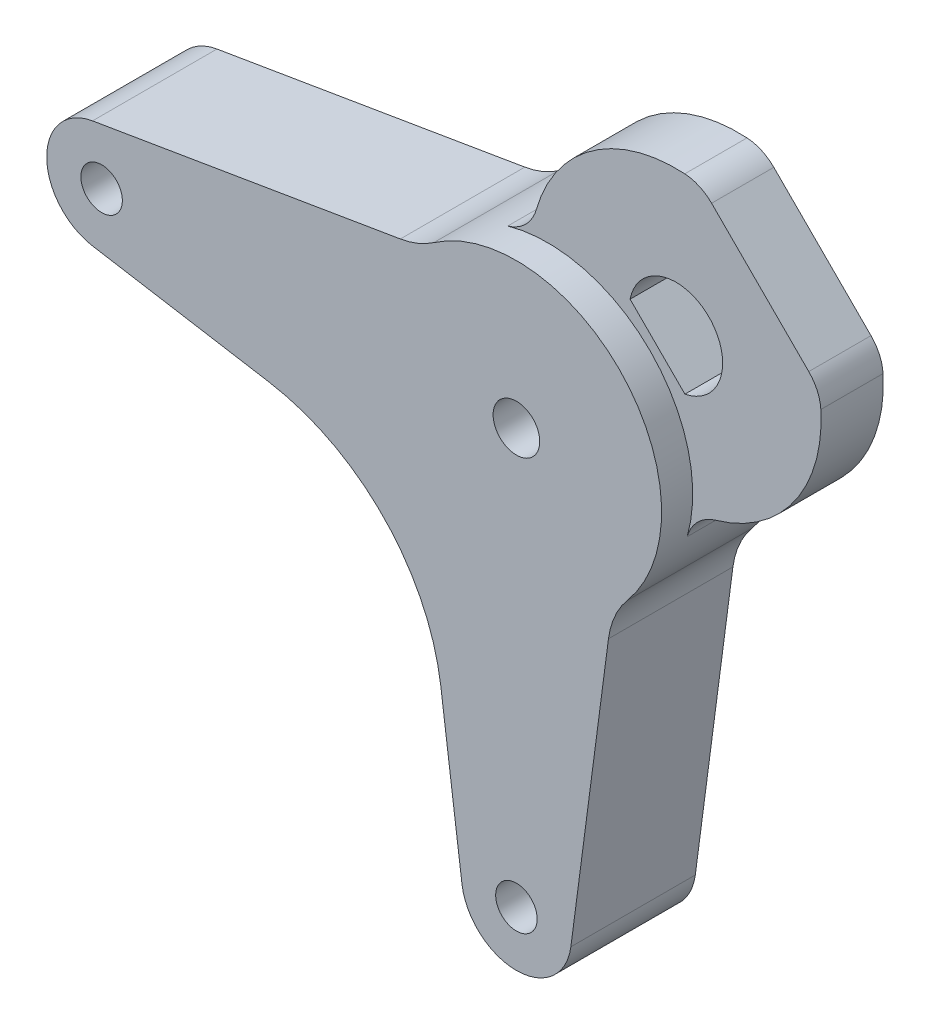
ISO-10303-21;
HEADER;
FILE_DESCRIPTION(('STEP AP214'),'2;1');
FILE_NAME('part.step','',(''),(''),'','','');
FILE_SCHEMA(('AUTOMOTIVE_DESIGN { 1 0 10303 214 1 1 1 1 }'));
ENDSEC;
DATA;
#1=APPLICATION_CONTEXT('core data for automotive mechanical design processes');
#2=APPLICATION_PROTOCOL_DEFINITION('international standard','automotive_design',2000,#1);
#3=PRODUCT_CONTEXT('',#1,'mechanical');
#4=PRODUCT('Part','Part','',(#3));
#5=PRODUCT_RELATED_PRODUCT_CATEGORY('part','',(#4));
#6=PRODUCT_DEFINITION_FORMATION('','',#4);
#7=PRODUCT_DEFINITION_CONTEXT('part definition',#1,'design');
#8=PRODUCT_DEFINITION('design','',#6,#7);
#9=PRODUCT_DEFINITION_SHAPE('','',#8);
#10=(LENGTH_UNIT() NAMED_UNIT(*) SI_UNIT(.MILLI.,.METRE.));
#11=(NAMED_UNIT(*) PLANE_ANGLE_UNIT() SI_UNIT($,.RADIAN.));
#12=(NAMED_UNIT(*) SI_UNIT($,.STERADIAN.) SOLID_ANGLE_UNIT());
#13=UNCERTAINTY_MEASURE_WITH_UNIT(LENGTH_MEASURE(1.E-05),#10,'distance_accuracy_value','');
#14=(GEOMETRIC_REPRESENTATION_CONTEXT(3) GLOBAL_UNCERTAINTY_ASSIGNED_CONTEXT((#13)) GLOBAL_UNIT_ASSIGNED_CONTEXT((#10,
#11,#12)) REPRESENTATION_CONTEXT('',''));
#15=CARTESIAN_POINT('',(0.,0.,0.));
#16=DIRECTION('',(0.,0.,1.));
#17=DIRECTION('',(1.,0.,0.));
#18=AXIS2_PLACEMENT_3D('',#15,#16,#17);
#19=CARTESIAN_POINT('',(23.9323052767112,174.611668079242,19.05));
#20=DIRECTION('',(0.,0.,-1.));
#21=DIRECTION('',(-1.,0.,0.));
#22=AXIS2_PLACEMENT_3D('',#19,#20,#21);
#23=CYLINDRICAL_SURFACE('',#22,16.8148);
#24=CARTESIAN_POINT('',(23.9323052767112,174.611668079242,-19.05));
#25=DIRECTION('',(0.,0.,1.));
#26=DIRECTION('',(1.,0.,0.));
#27=AXIS2_PLACEMENT_3D('',#24,#25,#26);
#28=CIRCLE('',#27,16.8148);
#29=CARTESIAN_POINT('',(21.1498454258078,191.19465382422,-19.05));
#30=VERTEX_POINT('',#29);
#31=CARTESIAN_POINT('',(21.1498454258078,158.028682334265,-19.05));
#32=VERTEX_POINT('',#31);
#33=EDGE_CURVE('E181',#30,#32,#28,.T.);
#34=ORIENTED_EDGE('',*,*,#33,.T.);
#35=DIRECTION('',(0.,0.,-1.));
#36=VECTOR('',#35,1.);
#37=CARTESIAN_POINT('',(21.1498454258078,158.028682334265,19.05));
#38=LINE('',#37,#36);
#39=CARTESIAN_POINT('',(21.1498454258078,158.028682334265,19.05));
#40=VERTEX_POINT('',#39);
#41=EDGE_CURVE('E280',#40,#32,#38,.T.);
#42=ORIENTED_EDGE('',*,*,#41,.F.);
#43=CARTESIAN_POINT('',(23.9323052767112,174.611668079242,19.05));
#44=DIRECTION('',(0.,0.,1.));
#45=DIRECTION('',(1.,0.,0.));
#46=AXIS2_PLACEMENT_3D('',#43,#44,#45);
#47=CIRCLE('',#46,16.8148);
#48=CARTESIAN_POINT('',(21.1498454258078,191.19465382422,19.05));
#49=VERTEX_POINT('',#48);
#50=EDGE_CURVE('E235',#49,#40,#47,.T.);
#51=ORIENTED_EDGE('',*,*,#50,.F.);
#52=DIRECTION('',(0.,0.,-1.));
#53=VECTOR('',#52,1.);
#54=CARTESIAN_POINT('',(21.1498454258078,191.19465382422,19.05));
#55=LINE('',#54,#53);
#56=EDGE_CURVE('E261',#49,#30,#55,.T.);
#57=ORIENTED_EDGE('',*,*,#56,.T.);
#58=EDGE_LOOP('',(#34,#42,#51,#57));
#59=FACE_BOUND('',#58,.T.);
#60=ADVANCED_FACE('F33',(#59),#23,.T.);
#61=CARTESIAN_POINT('',(21.1498454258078,158.028682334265,19.05));
#62=DIRECTION('',(0.165476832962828,0.98621367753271,0.));
#63=DIRECTION('',(-0.98621367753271,0.165476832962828,0.));
#64=AXIS2_PLACEMENT_3D('',#61,#62,#63);
#65=PLANE('',#64);
#66=DIRECTION('',(0.98621367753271,-0.165476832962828,0.));
#67=VECTOR('',#66,1.);
#68=CARTESIAN_POINT('',(21.1498454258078,158.028682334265,-19.05));
#69=LINE('',#68,#67);
#70=CARTESIAN_POINT('',(75.3372547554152,148.936574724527,-19.05));
#71=VERTEX_POINT('',#70);
#72=EDGE_CURVE('E209',#32,#71,#69,.T.);
#73=ORIENTED_EDGE('',*,*,#72,.T.);
#74=DIRECTION('',(0.,0.,-1.));
#75=VECTOR('',#74,1.);
#76=CARTESIAN_POINT('',(75.3372547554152,148.936574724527,19.05));
#77=LINE('',#76,#75);
#78=CARTESIAN_POINT('',(75.3372547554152,148.936574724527,19.05));
#79=VERTEX_POINT('',#78);
#80=EDGE_CURVE('E278',#79,#71,#77,.T.);
#81=ORIENTED_EDGE('',*,*,#80,.F.);
#82=DIRECTION('',(0.98621367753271,-0.165476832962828,0.));
#83=VECTOR('',#82,1.);
#84=CARTESIAN_POINT('',(21.1498454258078,158.028682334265,19.05));
#85=LINE('',#84,#83);
#86=EDGE_CURVE('E238',#40,#79,#85,.T.);
#87=ORIENTED_EDGE('',*,*,#86,.F.);
#88=ORIENTED_EDGE('',*,*,#41,.T.);
#89=EDGE_LOOP('',(#73,#81,#87,#88));
#90=FACE_BOUND('',#89,.T.);
#91=ADVANCED_FACE('F391',(#90),#65,.F.);
#92=CARTESIAN_POINT('',(64.829475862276,86.3120062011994,19.05));
#93=DIRECTION('',(0.,0.,-1.));
#94=DIRECTION('',(-1.,0.,0.));
#95=AXIS2_PLACEMENT_3D('',#92,#93,#94);
#96=CYLINDRICAL_SURFACE('',#95,63.5);
#97=CARTESIAN_POINT('',(64.829475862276,86.3120062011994,-19.05));
#98=DIRECTION('',(0.,0.,1.));
#99=DIRECTION('',(1.,0.,0.));
#100=AXIS2_PLACEMENT_3D('',#97,#98,#99);
#101=CIRCLE('',#100,63.5);
#102=CARTESIAN_POINT('',(127.786224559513,94.6004194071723,-19.05));
#103=VERTEX_POINT('',#102);
#104=EDGE_CURVE('E212',#103,#71,#101,.T.);
#105=ORIENTED_EDGE('',*,*,#104,.F.);
#106=DIRECTION('',(0.,0.,-1.));
#107=VECTOR('',#106,1.);
#108=CARTESIAN_POINT('',(127.786224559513,94.6004194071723,19.05));
#109=LINE('',#108,#107);
#110=CARTESIAN_POINT('',(127.786224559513,94.6004194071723,19.05));
#111=VERTEX_POINT('',#110);
#112=EDGE_CURVE('E276',#111,#103,#109,.T.);
#113=ORIENTED_EDGE('',*,*,#112,.F.);
#114=CARTESIAN_POINT('',(64.829475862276,86.3120062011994,19.05));
#115=DIRECTION('',(0.,0.,1.));
#116=DIRECTION('',(1.,0.,0.));
#117=AXIS2_PLACEMENT_3D('',#114,#115,#116);
#118=CIRCLE('',#117,63.5);
#119=EDGE_CURVE('E240',#111,#79,#118,.T.);
#120=ORIENTED_EDGE('',*,*,#119,.T.);
#121=ORIENTED_EDGE('',*,*,#80,.T.);
#122=EDGE_LOOP('',(#105,#113,#120,#121));
#123=FACE_BOUND('',#122,.T.);
#124=ADVANCED_FACE('F394',(#123),#96,.F.);
#125=CARTESIAN_POINT('',(134.261358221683,45.4168962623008,19.05));
#126=DIRECTION('',(-0.99144486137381,-0.130526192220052,0.));
#127=DIRECTION('',(0.130526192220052,-0.99144486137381,0.));
#128=AXIS2_PLACEMENT_3D('',#125,#126,#127);
#129=PLANE('',#128);
#130=DIRECTION('',(-0.130526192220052,0.99144486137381,0.));
#131=VECTOR('',#130,1.);
#132=CARTESIAN_POINT('',(134.261358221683,45.4168962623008,-19.05));
#133=LINE('',#132,#131);
#134=CARTESIAN_POINT('',(134.261358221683,45.4168962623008,-19.05));
#135=VERTEX_POINT('',#134);
#136=EDGE_CURVE('E215',#135,#103,#133,.T.);
#137=ORIENTED_EDGE('',*,*,#136,.F.);
#138=DIRECTION('',(0.,0.,-1.));
#139=VECTOR('',#138,1.);
#140=CARTESIAN_POINT('',(134.261358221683,45.4168962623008,19.05));
#141=LINE('',#140,#139);
#142=CARTESIAN_POINT('',(134.261358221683,45.4168962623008,19.05));
#143=VERTEX_POINT('',#142);
#144=EDGE_CURVE('E274',#143,#135,#141,.T.);
#145=ORIENTED_EDGE('',*,*,#144,.F.);
#146=DIRECTION('',(-0.130526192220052,0.99144486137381,0.));
#147=VECTOR('',#146,1.);
#148=CARTESIAN_POINT('',(134.261358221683,45.4168962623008,19.05));
#149=LINE('',#148,#147);
#150=EDGE_CURVE('E243',#143,#111,#149,.T.);
#151=ORIENTED_EDGE('',*,*,#150,.T.);
#152=ORIENTED_EDGE('',*,*,#112,.T.);
#153=EDGE_LOOP('',(#137,#145,#151,#152));
#154=FACE_BOUND('',#153,.T.);
#155=ADVANCED_FACE('F398',(#154),#129,.T.);
#156=CARTESIAN_POINT('',(150.932305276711,47.6116680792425,19.05));
#157=DIRECTION('',(0.,0.,-1.));
#158=DIRECTION('',(-1.,0.,0.));
#159=AXIS2_PLACEMENT_3D('',#156,#157,#158);
#160=CYLINDRICAL_SURFACE('',#159,16.8148);
#161=CARTESIAN_POINT('',(150.932305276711,47.6116680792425,-19.05));
#162=DIRECTION('',(0.,0.,1.));
#163=DIRECTION('',(1.,0.,0.));
#164=AXIS2_PLACEMENT_3D('',#161,#162,#163);
#165=CIRCLE('',#164,16.8148);
#166=CARTESIAN_POINT('',(167.60325233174,45.4168962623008,-19.05));
#167=VERTEX_POINT('',#166);
#168=EDGE_CURVE('E218',#135,#167,#165,.T.);
#169=ORIENTED_EDGE('',*,*,#168,.T.);
#170=DIRECTION('',(0.,0.,-1.));
#171=VECTOR('',#170,1.);
#172=CARTESIAN_POINT('',(167.60325233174,45.4168962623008,19.05));
#173=LINE('',#172,#171);
#174=CARTESIAN_POINT('',(167.60325233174,45.4168962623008,19.05));
#175=VERTEX_POINT('',#174);
#176=EDGE_CURVE('E271',#175,#167,#173,.T.);
#177=ORIENTED_EDGE('',*,*,#176,.F.);
#178=CARTESIAN_POINT('',(150.932305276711,47.6116680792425,19.05));
#179=DIRECTION('',(0.,0.,1.));
#180=DIRECTION('',(1.,0.,0.));
#181=AXIS2_PLACEMENT_3D('',#178,#179,#180);
#182=CIRCLE('',#181,16.8148);
#183=EDGE_CURVE('E246',#143,#175,#182,.T.);
#184=ORIENTED_EDGE('',*,*,#183,.F.);
#185=ORIENTED_EDGE('',*,*,#144,.T.);
#186=EDGE_LOOP('',(#169,#177,#184,#185));
#187=FACE_BOUND('',#186,.T.);
#188=ADVANCED_FACE('F403',(#187),#160,.T.);
#189=CARTESIAN_POINT('',(167.60325233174,45.4168962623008,19.05));
#190=DIRECTION('',(-0.99144486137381,0.130526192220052,0.));
#191=DIRECTION('',(-0.130526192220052,-0.99144486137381,0.));
#192=AXIS2_PLACEMENT_3D('',#189,#190,#191);
#193=PLANE('',#192);
#194=DIRECTION('',(0.130526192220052,0.99144486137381,0.));
#195=VECTOR('',#194,1.);
#196=CARTESIAN_POINT('',(167.60325233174,45.4168962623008,-19.05));
#197=LINE('',#196,#195);
#198=CARTESIAN_POINT('',(179.11521382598,132.858925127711,-19.05));
#199=VERTEX_POINT('',#198);
#200=EDGE_CURVE('E220',#167,#199,#197,.T.);
#201=ORIENTED_EDGE('',*,*,#200,.T.);
#202=DIRECTION('',(0.,0.,-1.));
#203=VECTOR('',#202,1.);
#204=CARTESIAN_POINT('',(179.11521382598,132.858925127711,19.05));
#205=LINE('',#204,#203);
#206=CARTESIAN_POINT('',(179.11521382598,132.858925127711,19.05));
#207=VERTEX_POINT('',#206);
#208=EDGE_CURVE('E269',#207,#199,#205,.T.);
#209=ORIENTED_EDGE('',*,*,#208,.F.);
#210=DIRECTION('',(0.130526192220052,0.99144486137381,0.));
#211=VECTOR('',#210,1.);
#212=CARTESIAN_POINT('',(167.60325233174,45.4168962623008,19.05));
#213=LINE('',#212,#211);
#214=EDGE_CURVE('E248',#175,#207,#213,.T.);
#215=ORIENTED_EDGE('',*,*,#214,.F.);
#216=ORIENTED_EDGE('',*,*,#176,.T.);
#217=EDGE_LOOP('',(#201,#209,#215,#216));
#218=FACE_BOUND('',#217,.T.);
#219=ADVANCED_FACE('F408',(#218),#193,.F.);
#220=CARTESIAN_POINT('',(204.297913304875,129.543559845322,19.05));
#221=DIRECTION('',(0.,0.,-1.));
#222=DIRECTION('',(-1.,0.,0.));
#223=AXIS2_PLACEMENT_3D('',#220,#221,#222);
#224=CYLINDRICAL_SURFACE('',#223,25.4);
#225=CARTESIAN_POINT('',(204.297913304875,129.543559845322,-19.05));
#226=DIRECTION('',(0.,0.,1.));
#227=DIRECTION('',(1.,0.,0.));
#228=AXIS2_PLACEMENT_3D('',#225,#226,#227);
#229=CIRCLE('',#228,25.4);
#230=CARTESIAN_POINT('',(184.89223765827,145.931962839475,-19.05));
#231=VERTEX_POINT('',#230);
#232=EDGE_CURVE('E223',#231,#199,#229,.T.);
#233=ORIENTED_EDGE('',*,*,#232,.F.);
#234=DIRECTION('',(0.,0.,-1.));
#235=VECTOR('',#234,1.);
#236=CARTESIAN_POINT('',(184.89223765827,145.931962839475,19.05));
#237=LINE('',#236,#235);
#238=CARTESIAN_POINT('',(184.89223765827,145.931962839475,19.05));
#239=VERTEX_POINT('',#238);
#240=EDGE_CURVE('E267',#239,#231,#237,.T.);
#241=ORIENTED_EDGE('',*,*,#240,.F.);
#242=CARTESIAN_POINT('',(204.297913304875,129.543559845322,19.05));
#243=DIRECTION('',(0.,0.,1.));
#244=DIRECTION('',(1.,0.,0.));
#245=AXIS2_PLACEMENT_3D('',#242,#243,#244);
#246=CIRCLE('',#245,25.4);
#247=EDGE_CURVE('E250',#239,#207,#246,.T.);
#248=ORIENTED_EDGE('',*,*,#247,.T.);
#249=ORIENTED_EDGE('',*,*,#208,.T.);
#250=EDGE_LOOP('',(#233,#241,#248,#249));
#251=FACE_BOUND('',#250,.T.);
#252=ADVANCED_FACE('F412',(#251),#224,.F.);
#253=CARTESIAN_POINT('',(150.932305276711,174.611668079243,19.05));
#254=DIRECTION('',(0.,0.,-1.));
#255=DIRECTION('',(-1.,0.,0.));
#256=AXIS2_PLACEMENT_3D('',#253,#254,#255);
#257=CYLINDRICAL_SURFACE('',#256,44.45);
#258=CARTESIAN_POINT('',(150.932305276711,174.611668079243,-9.525));
#259=DIRECTION('',(0.,0.,1.));
#260=DIRECTION('',(1.,0.,0.));
#261=AXIS2_PLACEMENT_3D('',#258,#259,#260);
#262=CIRCLE('',#261,44.45);
#263=CARTESIAN_POINT('',(193.682790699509,162.437987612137,-9.525));
#264=VERTEX_POINT('',#263);
#265=CARTESIAN_POINT('',(138.758624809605,217.36215350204,-9.525));
#266=VERTEX_POINT('',#265);
#267=EDGE_CURVE('E319',#264,#266,#262,.T.);
#268=ORIENTED_EDGE('',*,*,#267,.F.);
#269=DIRECTION('',(0.,0.,-1.));
#270=VECTOR('',#269,1.);
#271=CARTESIAN_POINT('',(193.682790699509,162.437987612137,19.05));
#272=LINE('',#271,#270);
#273=CARTESIAN_POINT('',(193.682790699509,162.437987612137,9.525));
#274=VERTEX_POINT('',#273);
#275=EDGE_CURVE('E291',#264,#274,#272,.F.);
#276=ORIENTED_EDGE('',*,*,#275,.T.);
#277=CARTESIAN_POINT('',(150.932305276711,174.611668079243,9.525));
#278=DIRECTION('',(0.,0.,1.));
#279=DIRECTION('',(1.,0.,0.));
#280=AXIS2_PLACEMENT_3D('',#277,#278,#279);
#281=CIRCLE('',#280,44.45);
#282=CARTESIAN_POINT('',(138.758624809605,217.36215350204,9.525));
#283=VERTEX_POINT('',#282);
#284=EDGE_CURVE('E191',#274,#283,#281,.T.);
#285=ORIENTED_EDGE('',*,*,#284,.T.);
#286=DIRECTION('',(0.,0.,-1.));
#287=VECTOR('',#286,1.);
#288=CARTESIAN_POINT('',(138.758624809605,217.36215350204,19.05));
#289=LINE('',#288,#287);
#290=EDGE_CURVE('E288',#283,#266,#289,.T.);
#291=ORIENTED_EDGE('',*,*,#290,.T.);
#292=EDGE_LOOP('',(#268,#276,#285,#291));
#293=FACE_BOUND('',#292,.T.);
#294=CARTESIAN_POINT('',(150.932305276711,174.611668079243,-19.05));
#295=DIRECTION('',(0.,0.,1.));
#296=DIRECTION('',(1.,0.,0.));
#297=AXIS2_PLACEMENT_3D('',#294,#295,#296);
#298=CIRCLE('',#297,44.45);
#299=CARTESIAN_POINT('',(125.646600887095,211.168960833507,-19.05));
#300=VERTEX_POINT('',#299);
#301=EDGE_CURVE('E226',#231,#300,#298,.T.);
#302=ORIENTED_EDGE('',*,*,#301,.T.);
#303=DIRECTION('',(0.,0.,-1.));
#304=VECTOR('',#303,1.);
#305=CARTESIAN_POINT('',(125.646600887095,211.168960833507,19.05));
#306=LINE('',#305,#304);
#307=CARTESIAN_POINT('',(125.646600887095,211.168960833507,19.05));
#308=VERTEX_POINT('',#307);
#309=EDGE_CURVE('E265',#308,#300,#306,.T.);
#310=ORIENTED_EDGE('',*,*,#309,.F.);
#311=CARTESIAN_POINT('',(150.932305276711,174.611668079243,19.05));
#312=DIRECTION('',(0.,0.,1.));
#313=DIRECTION('',(1.,0.,0.));
#314=AXIS2_PLACEMENT_3D('',#311,#312,#313);
#315=CIRCLE('',#314,44.45);
#316=EDGE_CURVE('E253',#239,#308,#315,.T.);
#317=ORIENTED_EDGE('',*,*,#316,.F.);
#318=ORIENTED_EDGE('',*,*,#240,.T.);
#319=EDGE_LOOP('',(#302,#310,#317,#318));
#320=FACE_BOUND('',#319,.T.);
#321=ADVANCED_FACE('F417',(#293,#320),#257,.T.);
#322=CARTESIAN_POINT('',(111.197626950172,232.058842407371,19.05));
#323=DIRECTION('',(0.,0.,-1.));
#324=DIRECTION('',(-1.,0.,0.));
#325=AXIS2_PLACEMENT_3D('',#322,#323,#324);
#326=CYLINDRICAL_SURFACE('',#325,25.4);
#327=CARTESIAN_POINT('',(111.197626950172,232.058842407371,-19.05));
#328=DIRECTION('',(0.,0.,1.));
#329=DIRECTION('',(1.,0.,0.));
#330=AXIS2_PLACEMENT_3D('',#327,#328,#329);
#331=CIRCLE('',#330,25.4);
#332=CARTESIAN_POINT('',(115.400738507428,207.009014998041,-19.05));
#333=VERTEX_POINT('',#332);
#334=EDGE_CURVE('E229',#333,#300,#331,.T.);
#335=ORIENTED_EDGE('',*,*,#334,.F.);
#336=DIRECTION('',(0.,0.,-1.));
#337=VECTOR('',#336,1.);
#338=CARTESIAN_POINT('',(115.400738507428,207.009014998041,19.05));
#339=LINE('',#338,#337);
#340=CARTESIAN_POINT('',(115.400738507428,207.009014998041,19.05));
#341=VERTEX_POINT('',#340);
#342=EDGE_CURVE('E263',#341,#333,#339,.T.);
#343=ORIENTED_EDGE('',*,*,#342,.F.);
#344=CARTESIAN_POINT('',(111.197626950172,232.058842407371,19.05));
#345=DIRECTION('',(0.,0.,1.));
#346=DIRECTION('',(1.,0.,0.));
#347=AXIS2_PLACEMENT_3D('',#344,#345,#346);
#348=CIRCLE('',#347,25.4);
#349=EDGE_CURVE('E255',#341,#308,#348,.T.);
#350=ORIENTED_EDGE('',*,*,#349,.T.);
#351=ORIENTED_EDGE('',*,*,#309,.T.);
#352=EDGE_LOOP('',(#335,#343,#350,#351));
#353=FACE_BOUND('',#352,.T.);
#354=ADVANCED_FACE('F423',(#353),#326,.F.);
#355=CARTESIAN_POINT('',(21.1498454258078,191.19465382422,19.05));
#356=DIRECTION('',(-0.165476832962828,0.98621367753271,0.));
#357=DIRECTION('',(-0.98621367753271,-0.165476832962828,0.));
#358=AXIS2_PLACEMENT_3D('',#355,#356,#357);
#359=PLANE('',#358);
#360=DIRECTION('',(0.98621367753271,0.165476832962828,0.));
#361=VECTOR('',#360,1.);
#362=CARTESIAN_POINT('',(21.1498454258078,191.19465382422,-19.05));
#363=LINE('',#362,#361);
#364=EDGE_CURVE('E232',#30,#333,#363,.T.);
#365=ORIENTED_EDGE('',*,*,#364,.F.);
#366=ORIENTED_EDGE('',*,*,#56,.F.);
#367=DIRECTION('',(0.98621367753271,0.165476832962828,0.));
#368=VECTOR('',#367,1.);
#369=CARTESIAN_POINT('',(21.1498454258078,191.19465382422,19.05));
#370=LINE('',#369,#368);
#371=EDGE_CURVE('E258',#49,#341,#370,.T.);
#372=ORIENTED_EDGE('',*,*,#371,.T.);
#373=ORIENTED_EDGE('',*,*,#342,.T.);
#374=EDGE_LOOP('',(#365,#366,#372,#373));
#375=FACE_BOUND('',#374,.T.);
#376=ADVANCED_FACE('F376',(#375),#359,.T.);
#377=CARTESIAN_POINT('',(23.9323052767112,174.611668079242,19.05));
#378=DIRECTION('',(0.,0.,1.));
#379=DIRECTION('',(1.,0.,0.));
#380=AXIS2_PLACEMENT_3D('',#377,#378,#379);
#381=PLANE('',#380);
#382=CARTESIAN_POINT('',(150.932305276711,174.611668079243,19.05));
#383=DIRECTION('',(0.,0.,1.));
#384=DIRECTION('',(1.,0.,0.));
#385=AXIS2_PLACEMENT_3D('',#382,#383,#384);
#386=CIRCLE('',#385,7.14375);
#387=CARTESIAN_POINT('',(158.076055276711,174.611668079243,19.05));
#388=VERTEX_POINT('',#387);
#389=EDGE_CURVE('E355',#388,#388,#386,.T.);
#390=ORIENTED_EDGE('',*,*,#389,.F.);
#391=EDGE_LOOP('',(#390));
#392=FACE_BOUND('',#391,.T.);
#393=CARTESIAN_POINT('',(23.9323052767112,174.611668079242,19.05));
#394=DIRECTION('',(0.,0.,1.));
#395=DIRECTION('',(1.,0.,0.));
#396=AXIS2_PLACEMENT_3D('',#393,#394,#395);
#397=CIRCLE('',#396,6.35);
#398=CARTESIAN_POINT('',(30.2823052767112,174.611668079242,19.05));
#399=VERTEX_POINT('',#398);
#400=EDGE_CURVE('E349',#399,#399,#397,.T.);
#401=ORIENTED_EDGE('',*,*,#400,.F.);
#402=EDGE_LOOP('',(#401));
#403=FACE_BOUND('',#402,.T.);
#404=CARTESIAN_POINT('',(150.932305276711,47.6116680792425,19.05));
#405=DIRECTION('',(0.,0.,1.));
#406=DIRECTION('',(1.,0.,0.));
#407=AXIS2_PLACEMENT_3D('',#404,#405,#406);
#408=CIRCLE('',#407,6.34999999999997);
#409=CARTESIAN_POINT('',(157.282305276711,47.6116680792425,19.05));
#410=VERTEX_POINT('',#409);
#411=EDGE_CURVE('E346',#410,#410,#408,.T.);
#412=ORIENTED_EDGE('',*,*,#411,.F.);
#413=EDGE_LOOP('',(#412));
#414=FACE_BOUND('',#413,.T.);
#415=ORIENTED_EDGE('',*,*,#50,.T.);
#416=ORIENTED_EDGE('',*,*,#86,.T.);
#417=ORIENTED_EDGE('',*,*,#119,.F.);
#418=ORIENTED_EDGE('',*,*,#150,.F.);
#419=ORIENTED_EDGE('',*,*,#183,.T.);
#420=ORIENTED_EDGE('',*,*,#214,.T.);
#421=ORIENTED_EDGE('',*,*,#247,.F.);
#422=ORIENTED_EDGE('',*,*,#316,.T.);
#423=ORIENTED_EDGE('',*,*,#349,.F.);
#424=ORIENTED_EDGE('',*,*,#371,.F.);
#425=EDGE_LOOP('',(#415,#416,#417,#418,#419,#420,#421,#422,#423,#424));
#426=FACE_BOUND('',#425,.T.);
#427=ADVANCED_FACE('F373',(#392,#403,#414,#426),#381,.T.);
#428=CARTESIAN_POINT('',(23.9323052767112,174.611668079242,-19.05));
#429=DIRECTION('',(0.,0.,1.));
#430=DIRECTION('',(1.,0.,0.));
#431=AXIS2_PLACEMENT_3D('',#428,#429,#430);
#432=PLANE('',#431);
#433=CARTESIAN_POINT('',(150.932305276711,174.611668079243,-19.05));
#434=DIRECTION('',(0.,0.,1.));
#435=DIRECTION('',(1.,0.,0.));
#436=AXIS2_PLACEMENT_3D('',#433,#434,#435);
#437=CIRCLE('',#436,7.14375);
#438=CARTESIAN_POINT('',(158.076055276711,174.611668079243,-19.05));
#439=VERTEX_POINT('',#438);
#440=EDGE_CURVE('E358',#439,#439,#437,.T.);
#441=ORIENTED_EDGE('',*,*,#440,.T.);
#442=EDGE_LOOP('',(#441));
#443=FACE_BOUND('',#442,.T.);
#444=CARTESIAN_POINT('',(23.9323052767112,174.611668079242,-19.05));
#445=DIRECTION('',(0.,0.,1.));
#446=DIRECTION('',(1.,0.,0.));
#447=AXIS2_PLACEMENT_3D('',#444,#445,#446);
#448=CIRCLE('',#447,6.35);
#449=CARTESIAN_POINT('',(30.2823052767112,174.611668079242,-19.05));
#450=VERTEX_POINT('',#449);
#451=EDGE_CURVE('E352',#450,#450,#448,.T.);
#452=ORIENTED_EDGE('',*,*,#451,.T.);
#453=EDGE_LOOP('',(#452));
#454=FACE_BOUND('',#453,.T.);
#455=CARTESIAN_POINT('',(150.932305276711,47.6116680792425,-19.05));
#456=DIRECTION('',(0.,0.,1.));
#457=DIRECTION('',(1.,0.,0.));
#458=AXIS2_PLACEMENT_3D('',#455,#456,#457);
#459=CIRCLE('',#458,6.34999999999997);
#460=CARTESIAN_POINT('',(157.282305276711,47.6116680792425,-19.05));
#461=VERTEX_POINT('',#460);
#462=EDGE_CURVE('E343',#461,#461,#459,.T.);
#463=ORIENTED_EDGE('',*,*,#462,.T.);
#464=EDGE_LOOP('',(#463));
#465=FACE_BOUND('',#464,.T.);
#466=ORIENTED_EDGE('',*,*,#33,.F.);
#467=ORIENTED_EDGE('',*,*,#364,.T.);
#468=ORIENTED_EDGE('',*,*,#334,.T.);
#469=ORIENTED_EDGE('',*,*,#301,.F.);
#470=ORIENTED_EDGE('',*,*,#232,.T.);
#471=ORIENTED_EDGE('',*,*,#200,.F.);
#472=ORIENTED_EDGE('',*,*,#168,.F.);
#473=ORIENTED_EDGE('',*,*,#136,.T.);
#474=ORIENTED_EDGE('',*,*,#104,.T.);
#475=ORIENTED_EDGE('',*,*,#72,.F.);
#476=EDGE_LOOP('',(#466,#467,#468,#469,#470,#471,#472,#473,#474,#475));
#477=FACE_BOUND('',#476,.T.);
#478=ADVANCED_FACE('F362',(#443,#454,#465,#477),#432,.F.);
#479=CARTESIAN_POINT('',(190.245340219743,213.924703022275,9.525));
#480=DIRECTION('',(0.,0.,-1.));
#481=DIRECTION('',(-1.,0.,0.));
#482=AXIS2_PLACEMENT_3D('',#479,#480,#481);
#483=CYLINDRICAL_SURFACE('',#482,14.3002);
#484=CARTESIAN_POINT('',(190.245340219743,213.924703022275,-9.525));
#485=DIRECTION('',(0.,0.,1.));
#486=DIRECTION('',(1.,0.,0.));
#487=AXIS2_PLACEMENT_3D('',#484,#485,#486);
#488=CIRCLE('',#487,14.3002);
#489=CARTESIAN_POINT('',(193.002981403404,199.892912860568,-9.525));
#490=VERTEX_POINT('',#489);
#491=CARTESIAN_POINT('',(176.213550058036,216.682344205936,-9.525));
#492=VERTEX_POINT('',#491);
#493=EDGE_CURVE('E185',#490,#492,#488,.T.);
#494=ORIENTED_EDGE('',*,*,#493,.F.);
#495=DIRECTION('',(0.,0.,-1.));
#496=VECTOR('',#495,1.);
#497=CARTESIAN_POINT('',(193.002981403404,199.892912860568,9.525));
#498=LINE('',#497,#496);
#499=CARTESIAN_POINT('',(193.002981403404,199.892912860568,9.525));
#500=VERTEX_POINT('',#499);
#501=EDGE_CURVE('E171',#500,#490,#498,.T.);
#502=ORIENTED_EDGE('',*,*,#501,.F.);
#503=CARTESIAN_POINT('',(190.245340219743,213.924703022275,9.525));
#504=DIRECTION('',(0.,0.,1.));
#505=DIRECTION('',(1.,0.,0.));
#506=AXIS2_PLACEMENT_3D('',#503,#504,#505);
#507=CIRCLE('',#506,14.3002);
#508=CARTESIAN_POINT('',(176.213550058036,216.682344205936,9.525));
#509=VERTEX_POINT('',#508);
#510=EDGE_CURVE('E203',#500,#509,#507,.T.);
#511=ORIENTED_EDGE('',*,*,#510,.T.);
#512=DIRECTION('',(0.,0.,-1.));
#513=VECTOR('',#512,1.);
#514=CARTESIAN_POINT('',(176.213550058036,216.682344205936,9.525));
#515=LINE('',#514,#513);
#516=EDGE_CURVE('E182',#509,#492,#515,.T.);
#517=ORIENTED_EDGE('',*,*,#516,.T.);
#518=EDGE_LOOP('',(#494,#502,#511,#517));
#519=FACE_BOUND('',#518,.T.);
#520=ADVANCED_FACE('F186',(#519),#483,.F.);
#521=CARTESIAN_POINT('',(190.245340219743,213.924703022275,9.525));
#522=DIRECTION('',(0.,0.,-1.));
#523=DIRECTION('',(-1.,0.,0.));
#524=AXIS2_PLACEMENT_3D('',#521,#522,#523);
#525=CYLINDRICAL_SURFACE('',#524,44.45);
#526=CARTESIAN_POINT('',(190.245340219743,213.924703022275,9.525));
#527=DIRECTION('',(0.,0.,1.));
#528=DIRECTION('',(1.,0.,0.));
#529=AXIS2_PLACEMENT_3D('',#526,#527,#528);
#530=CIRCLE('',#529,44.45);
#531=CARTESIAN_POINT('',(202.419020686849,171.174217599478,9.525));
#532=VERTEX_POINT('',#531);
#533=CARTESIAN_POINT('',(234.612608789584,216.635418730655,9.525));
#534=VERTEX_POINT('',#533);
#535=EDGE_CURVE('E193',#532,#534,#530,.T.);
#536=ORIENTED_EDGE('',*,*,#535,.F.);
#537=DIRECTION('',(0.,0.,-1.));
#538=VECTOR('',#537,1.);
#539=CARTESIAN_POINT('',(202.419020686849,171.174217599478,9.525));
#540=LINE('',#539,#538);
#541=CARTESIAN_POINT('',(202.419020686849,171.174217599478,-9.525));
#542=VERTEX_POINT('',#541);
#543=EDGE_CURVE('E285',#532,#542,#540,.T.);
#544=ORIENTED_EDGE('',*,*,#543,.T.);
#545=CARTESIAN_POINT('',(190.245340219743,213.924703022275,-9.525));
#546=DIRECTION('',(0.,0.,1.));
#547=DIRECTION('',(1.,0.,0.));
#548=AXIS2_PLACEMENT_3D('',#545,#546,#547);
#549=CIRCLE('',#548,44.45);
#550=CARTESIAN_POINT('',(234.612608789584,216.635418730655,-9.525));
#551=VERTEX_POINT('',#550);
#552=EDGE_CURVE('E337',#542,#551,#549,.T.);
#553=ORIENTED_EDGE('',*,*,#552,.T.);
#554=DIRECTION('',(0.,0.,-1.));
#555=VECTOR('',#554,1.);
#556=CARTESIAN_POINT('',(234.612608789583,216.635418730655,9.525));
#557=LINE('',#556,#555);
#558=EDGE_CURVE('E283',#551,#534,#557,.F.);
#559=ORIENTED_EDGE('',*,*,#558,.T.);
#560=EDGE_LOOP('',(#536,#544,#553,#559));
#561=FACE_BOUND('',#560,.T.);
#562=ADVANCED_FACE('F467',(#561),#525,.T.);
#563=CARTESIAN_POINT('',(332.116509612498,123.64117749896,9.525));
#564=DIRECTION('',(0.707106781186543,0.707106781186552,0.));
#565=DIRECTION('',(-0.707106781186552,0.707106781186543,0.));
#566=AXIS2_PLACEMENT_3D('',#563,#564,#565);
#567=PLANE('',#566);
#568=DIRECTION('',(0.707106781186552,-0.707106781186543,0.));
#569=VECTOR('',#568,1.);
#570=CARTESIAN_POINT('',(332.116509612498,123.64117749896,9.525));
#571=LINE('',#570,#569);
#572=CARTESIAN_POINT('',(201.161821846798,254.595865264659,9.525));
#573=VERTEX_POINT('',#572);
#574=CARTESIAN_POINT('',(230.916502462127,224.84118464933,9.525));
#575=VERTEX_POINT('',#574);
#576=EDGE_CURVE('E198',#573,#575,#571,.T.);
#577=ORIENTED_EDGE('',*,*,#576,.T.);
#578=DIRECTION('',(0.,0.,1.));
#579=VECTOR('',#578,1.);
#580=CARTESIAN_POINT('',(230.916502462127,224.84118464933,-9.52499999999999));
#581=LINE('',#580,#579);
#582=CARTESIAN_POINT('',(230.916502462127,224.84118464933,-9.525));
#583=VERTEX_POINT('',#582);
#584=EDGE_CURVE('E300',#575,#583,#581,.F.);
#585=ORIENTED_EDGE('',*,*,#584,.T.);
#586=DIRECTION('',(0.707106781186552,-0.707106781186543,0.));
#587=VECTOR('',#586,1.);
#588=CARTESIAN_POINT('',(332.116509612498,123.64117749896,-9.525));
#589=LINE('',#588,#587);
#590=CARTESIAN_POINT('',(201.161821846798,254.595865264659,-9.525));
#591=VERTEX_POINT('',#590);
#592=EDGE_CURVE('E327',#591,#583,#589,.T.);
#593=ORIENTED_EDGE('',*,*,#592,.F.);
#594=DIRECTION('',(0.,0.,1.));
#595=VECTOR('',#594,1.);
#596=CARTESIAN_POINT('',(201.161821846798,254.595865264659,9.525));
#597=LINE('',#596,#595);
#598=EDGE_CURVE('E54',#591,#573,#597,.T.);
#599=ORIENTED_EDGE('',*,*,#598,.T.);
#600=EDGE_LOOP('',(#577,#585,#593,#599));
#601=FACE_BOUND('',#600,.T.);
#602=ADVANCED_FACE('F335',(#601),#567,.T.);
#603=CARTESIAN_POINT('',(190.245340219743,213.924703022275,9.525));
#604=DIRECTION('',(0.,0.,-1.));
#605=DIRECTION('',(-1.,0.,0.));
#606=AXIS2_PLACEMENT_3D('',#603,#604,#605);
#607=CYLINDRICAL_SURFACE('',#606,44.45);
#608=CARTESIAN_POINT('',(190.245340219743,213.924703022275,-9.525));
#609=DIRECTION('',(0.,0.,1.));
#610=DIRECTION('',(1.,0.,0.));
#611=AXIS2_PLACEMENT_3D('',#608,#609,#610);
#612=CIRCLE('',#611,44.45);
#613=CARTESIAN_POINT('',(192.956055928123,258.291971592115,-9.525));
#614=VERTEX_POINT('',#613);
#615=CARTESIAN_POINT('',(147.494854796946,226.09838348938,-9.525));
#616=VERTEX_POINT('',#615);
#617=EDGE_CURVE('E188',#614,#616,#612,.T.);
#618=ORIENTED_EDGE('',*,*,#617,.T.);
#619=DIRECTION('',(0.,0.,-1.));
#620=VECTOR('',#619,1.);
#621=CARTESIAN_POINT('',(147.494854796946,226.09838348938,9.525));
#622=LINE('',#621,#620);
#623=CARTESIAN_POINT('',(147.494854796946,226.09838348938,9.525));
#624=VERTEX_POINT('',#623);
#625=EDGE_CURVE('E297',#616,#624,#622,.F.);
#626=ORIENTED_EDGE('',*,*,#625,.T.);
#627=CARTESIAN_POINT('',(190.245340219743,213.924703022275,9.525));
#628=DIRECTION('',(0.,0.,1.));
#629=DIRECTION('',(1.,0.,0.));
#630=AXIS2_PLACEMENT_3D('',#627,#628,#629);
#631=CIRCLE('',#630,44.45);
#632=CARTESIAN_POINT('',(192.956055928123,258.291971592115,9.525));
#633=VERTEX_POINT('',#632);
#634=EDGE_CURVE('E200',#633,#624,#631,.T.);
#635=ORIENTED_EDGE('',*,*,#634,.F.);
#636=DIRECTION('',(0.,0.,-1.));
#637=VECTOR('',#636,1.);
#638=CARTESIAN_POINT('',(192.956055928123,258.291971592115,9.525));
#639=LINE('',#638,#637);
#640=EDGE_CURVE('E294',#633,#614,#639,.T.);
#641=ORIENTED_EDGE('',*,*,#640,.T.);
#642=EDGE_LOOP('',(#618,#626,#635,#641));
#643=FACE_BOUND('',#642,.T.);
#644=ADVANCED_FACE('F324',(#643),#607,.T.);
#645=CARTESIAN_POINT('',(300.685613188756,92.2102810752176,9.525));
#646=DIRECTION('',(0.707106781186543,0.707106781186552,0.));
#647=DIRECTION('',(-0.707106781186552,0.707106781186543,0.));
#648=AXIS2_PLACEMENT_3D('',#645,#646,#647);
#649=PLANE('',#648);
#650=DIRECTION('',(0.707106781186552,-0.707106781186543,0.));
#651=VECTOR('',#650,1.);
#652=CARTESIAN_POINT('',(300.685613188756,92.2102810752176,-9.525));
#653=LINE('',#652,#651);
#654=EDGE_CURVE('E175',#492,#490,#653,.T.);
#655=ORIENTED_EDGE('',*,*,#654,.F.);
#656=ORIENTED_EDGE('',*,*,#516,.F.);
#657=DIRECTION('',(0.707106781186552,-0.707106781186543,0.));
#658=VECTOR('',#657,1.);
#659=CARTESIAN_POINT('',(300.685613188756,92.2102810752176,9.525));
#660=LINE('',#659,#658);
#661=EDGE_CURVE('E177',#509,#500,#660,.T.);
#662=ORIENTED_EDGE('',*,*,#661,.T.);
#663=ORIENTED_EDGE('',*,*,#501,.T.);
#664=EDGE_LOOP('',(#655,#656,#662,#663));
#665=FACE_BOUND('',#664,.T.);
#666=ADVANCED_FACE('F173',(#665),#649,.T.);
#667=CARTESIAN_POINT('',(126.815118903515,-81.6602132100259,9.525));
#668=DIRECTION('',(0.,0.,1.));
#669=DIRECTION('',(1.,0.,0.));
#670=AXIS2_PLACEMENT_3D('',#667,#668,#669);
#671=PLANE('',#670);
#672=ORIENTED_EDGE('',*,*,#535,.T.);
#673=CARTESIAN_POINT('',(221.936246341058,215.860928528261,9.525));
#674=DIRECTION('',(0.,0.,1.));
#675=DIRECTION('',(1.,0.,0.));
#676=AXIS2_PLACEMENT_3D('',#673,#674,#675);
#677=CIRCLE('',#676,12.7);
#678=EDGE_CURVE('E47',#534,#575,#677,.T.);
#679=ORIENTED_EDGE('',*,*,#678,.T.);
#680=ORIENTED_EDGE('',*,*,#576,.F.);
#681=CARTESIAN_POINT('',(192.181565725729,245.615609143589,9.525));
#682=DIRECTION('',(0.,0.,1.));
#683=DIRECTION('',(1.,0.,0.));
#684=AXIS2_PLACEMENT_3D('',#681,#682,#683);
#685=CIRCLE('',#684,12.7);
#686=EDGE_CURVE('E307',#573,#633,#685,.T.);
#687=ORIENTED_EDGE('',*,*,#686,.T.);
#688=ORIENTED_EDGE('',*,*,#634,.T.);
#689=CARTESIAN_POINT('',(135.280430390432,229.576577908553,9.525));
#690=DIRECTION('',(0.,0.,1.));
#691=DIRECTION('',(1.,0.,0.));
#692=AXIS2_PLACEMENT_3D('',#689,#690,#691);
#693=CIRCLE('',#692,12.7);
#694=EDGE_CURVE('E11',#624,#283,#693,.F.);
#695=ORIENTED_EDGE('',*,*,#694,.T.);
#696=ORIENTED_EDGE('',*,*,#284,.F.);
#697=CARTESIAN_POINT('',(205.897215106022,158.959793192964,9.525));
#698=DIRECTION('',(0.,0.,1.));
#699=DIRECTION('',(1.,0.,0.));
#700=AXIS2_PLACEMENT_3D('',#697,#698,#699);
#701=CIRCLE('',#700,12.7);
#702=EDGE_CURVE('E313',#274,#532,#701,.F.);
#703=ORIENTED_EDGE('',*,*,#702,.T.);
#704=EDGE_LOOP('',(#672,#679,#680,#687,#688,#695,#696,#703));
#705=FACE_BOUND('',#704,.T.);
#706=ORIENTED_EDGE('',*,*,#510,.F.);
#707=ORIENTED_EDGE('',*,*,#661,.F.);
#708=EDGE_LOOP('',(#706,#707));
#709=FACE_BOUND('',#708,.T.);
#710=ADVANCED_FACE('F330',(#705,#709),#671,.T.);
#711=CARTESIAN_POINT('',(126.815118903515,-81.6602132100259,-9.525));
#712=DIRECTION('',(0.,0.,1.));
#713=DIRECTION('',(1.,0.,0.));
#714=AXIS2_PLACEMENT_3D('',#711,#712,#713);
#715=PLANE('',#714);
#716=ORIENTED_EDGE('',*,*,#592,.T.);
#717=CARTESIAN_POINT('',(221.936246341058,215.860928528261,-9.525));
#718=DIRECTION('',(0.,0.,1.));
#719=DIRECTION('',(1.,0.,0.));
#720=AXIS2_PLACEMENT_3D('',#717,#718,#719);
#721=CIRCLE('',#720,12.7);
#722=EDGE_CURVE('E305',#583,#551,#721,.F.);
#723=ORIENTED_EDGE('',*,*,#722,.T.);
#724=ORIENTED_EDGE('',*,*,#552,.F.);
#725=CARTESIAN_POINT('',(205.897215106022,158.959793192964,-9.525));
#726=DIRECTION('',(0.,0.,1.));
#727=DIRECTION('',(1.,0.,0.));
#728=AXIS2_PLACEMENT_3D('',#725,#726,#727);
#729=CIRCLE('',#728,12.7);
#730=EDGE_CURVE('E310',#542,#264,#729,.T.);
#731=ORIENTED_EDGE('',*,*,#730,.T.);
#732=ORIENTED_EDGE('',*,*,#267,.T.);
#733=CARTESIAN_POINT('',(135.280430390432,229.576577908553,-9.525));
#734=DIRECTION('',(0.,0.,1.));
#735=DIRECTION('',(1.,0.,0.));
#736=AXIS2_PLACEMENT_3D('',#733,#734,#735);
#737=CIRCLE('',#736,12.7);
#738=EDGE_CURVE('E40',#266,#616,#737,.T.);
#739=ORIENTED_EDGE('',*,*,#738,.T.);
#740=ORIENTED_EDGE('',*,*,#617,.F.);
#741=CARTESIAN_POINT('',(192.181565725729,245.615609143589,-9.525));
#742=DIRECTION('',(0.,0.,1.));
#743=DIRECTION('',(1.,0.,0.));
#744=AXIS2_PLACEMENT_3D('',#741,#742,#743);
#745=CIRCLE('',#744,12.7);
#746=EDGE_CURVE('E303',#614,#591,#745,.F.);
#747=ORIENTED_EDGE('',*,*,#746,.T.);
#748=EDGE_LOOP('',(#716,#723,#724,#731,#732,#739,#740,#747));
#749=FACE_BOUND('',#748,.T.);
#750=ORIENTED_EDGE('',*,*,#493,.T.);
#751=ORIENTED_EDGE('',*,*,#654,.T.);
#752=EDGE_LOOP('',(#750,#751));
#753=FACE_BOUND('',#752,.T.);
#754=ADVANCED_FACE('F190',(#749,#753),#715,.F.);
#755=CARTESIAN_POINT('',(150.932305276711,47.6116680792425,-19.05));
#756=DIRECTION('',(0.,0.,1.));
#757=DIRECTION('',(1.,0.,0.));
#758=AXIS2_PLACEMENT_3D('',#755,#756,#757);
#759=CYLINDRICAL_SURFACE('',#758,6.34999999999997);
#760=CARTESIAN_POINT('',(157.282305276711,47.6116680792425,-19.05));
#761=CARTESIAN_POINT('',(157.282305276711,47.6116680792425,-18.653125));
#762=CARTESIAN_POINT('',(157.282305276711,47.6116680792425,-18.25625));
#763=CARTESIAN_POINT('',(157.282305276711,47.6116680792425,-17.4625));
#764=CARTESIAN_POINT('',(157.282305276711,47.6116680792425,-17.065625));
#765=CARTESIAN_POINT('',(157.282305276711,47.6116680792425,-16.271875));
#766=CARTESIAN_POINT('',(157.282305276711,47.6116680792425,-15.875));
#767=CARTESIAN_POINT('',(157.282305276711,47.6116680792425,-15.08125));
#768=CARTESIAN_POINT('',(157.282305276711,47.6116680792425,-14.684375));
#769=CARTESIAN_POINT('',(157.282305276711,47.6116680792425,-13.890625));
#770=CARTESIAN_POINT('',(157.282305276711,47.6116680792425,-13.49375));
#771=CARTESIAN_POINT('',(157.282305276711,47.6116680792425,-12.7));
#772=CARTESIAN_POINT('',(157.282305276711,47.6116680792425,-12.303125));
#773=CARTESIAN_POINT('',(157.282305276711,47.6116680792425,-11.509375));
#774=CARTESIAN_POINT('',(157.282305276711,47.6116680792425,-11.1125));
#775=CARTESIAN_POINT('',(157.282305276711,47.6116680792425,-10.31875));
#776=CARTESIAN_POINT('',(157.282305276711,47.6116680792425,-9.921875));
#777=CARTESIAN_POINT('',(157.282305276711,47.6116680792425,-9.128125));
#778=CARTESIAN_POINT('',(157.282305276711,47.6116680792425,-8.73125));
#779=CARTESIAN_POINT('',(157.282305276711,47.6116680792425,-7.9375));
#780=CARTESIAN_POINT('',(157.282305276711,47.6116680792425,-7.540625));
#781=CARTESIAN_POINT('',(157.282305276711,47.6116680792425,-6.746875));
#782=CARTESIAN_POINT('',(157.282305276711,47.6116680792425,-6.35));
#783=CARTESIAN_POINT('',(157.282305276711,47.6116680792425,-5.55625));
#784=CARTESIAN_POINT('',(157.282305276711,47.6116680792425,-5.159375));
#785=CARTESIAN_POINT('',(157.282305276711,47.6116680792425,-4.365625));
#786=CARTESIAN_POINT('',(157.282305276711,47.6116680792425,-3.96875));
#787=CARTESIAN_POINT('',(157.282305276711,47.6116680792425,-3.175));
#788=CARTESIAN_POINT('',(157.282305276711,47.6116680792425,-2.778125));
#789=CARTESIAN_POINT('',(157.282305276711,47.6116680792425,-1.984375));
#790=CARTESIAN_POINT('',(157.282305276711,47.6116680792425,-1.5875));
#791=CARTESIAN_POINT('',(157.282305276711,47.6116680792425,-0.793750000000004));
#792=CARTESIAN_POINT('',(157.282305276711,47.6116680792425,-0.396875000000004));
#793=CARTESIAN_POINT('',(157.282305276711,47.6116680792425,0.396874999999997));
#794=CARTESIAN_POINT('',(157.282305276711,47.6116680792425,0.793749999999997));
#795=CARTESIAN_POINT('',(157.282305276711,47.6116680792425,1.5875));
#796=CARTESIAN_POINT('',(157.282305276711,47.6116680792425,1.984375));
#797=CARTESIAN_POINT('',(157.282305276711,47.6116680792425,2.778125));
#798=CARTESIAN_POINT('',(157.282305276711,47.6116680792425,3.175));
#799=CARTESIAN_POINT('',(157.282305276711,47.6116680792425,3.96875));
#800=CARTESIAN_POINT('',(157.282305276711,47.6116680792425,4.365625));
#801=CARTESIAN_POINT('',(157.282305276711,47.6116680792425,5.159375));
#802=CARTESIAN_POINT('',(157.282305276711,47.6116680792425,5.55625));
#803=CARTESIAN_POINT('',(157.282305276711,47.6116680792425,6.35));
#804=CARTESIAN_POINT('',(157.282305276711,47.6116680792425,6.746875));
#805=CARTESIAN_POINT('',(157.282305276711,47.6116680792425,7.540625));
#806=CARTESIAN_POINT('',(157.282305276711,47.6116680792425,7.9375));
#807=CARTESIAN_POINT('',(157.282305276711,47.6116680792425,8.73125));
#808=CARTESIAN_POINT('',(157.282305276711,47.6116680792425,9.128125));
#809=CARTESIAN_POINT('',(157.282305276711,47.6116680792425,9.921875));
#810=CARTESIAN_POINT('',(157.282305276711,47.6116680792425,10.31875));
#811=CARTESIAN_POINT('',(157.282305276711,47.6116680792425,11.1125));
#812=CARTESIAN_POINT('',(157.282305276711,47.6116680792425,11.509375));
#813=CARTESIAN_POINT('',(157.282305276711,47.6116680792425,12.303125));
#814=CARTESIAN_POINT('',(157.282305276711,47.6116680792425,12.7));
#815=CARTESIAN_POINT('',(157.282305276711,47.6116680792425,13.49375));
#816=CARTESIAN_POINT('',(157.282305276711,47.6116680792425,13.890625));
#817=CARTESIAN_POINT('',(157.282305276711,47.6116680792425,14.684375));
#818=CARTESIAN_POINT('',(157.282305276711,47.6116680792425,15.08125));
#819=CARTESIAN_POINT('',(157.282305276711,47.6116680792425,15.875));
#820=CARTESIAN_POINT('',(157.282305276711,47.6116680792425,16.271875));
#821=CARTESIAN_POINT('',(157.282305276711,47.6116680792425,17.065625));
#822=CARTESIAN_POINT('',(157.282305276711,47.6116680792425,17.4625));
#823=CARTESIAN_POINT('',(157.282305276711,47.6116680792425,18.25625));
#824=CARTESIAN_POINT('',(157.282305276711,47.6116680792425,18.653125));
#825=CARTESIAN_POINT('',(157.282305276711,47.6116680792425,19.05));
#826=B_SPLINE_CURVE_WITH_KNOTS('',3,(#760,#761,#762,#763,#764,#765,#766,#767,#768,#769,#770,
#771,#772,#773,#774,#775,#776,#777,#778,#779,#780,#781,#782,#783,#784,#785,#786,#787,#788,#789,
#790,#791,#792,#793,#794,#795,#796,#797,#798,#799,#800,#801,#802,#803,#804,#805,#806,#807,#808,
#809,#810,#811,#812,#813,#814,#815,#816,#817,#818,#819,#820,#821,#822,#823,#824,#825),
.UNSPECIFIED.,.F.,.F.,(4,2,2,2,2,2,2,2,2,2,2,2,2,2,2,2,2,2,2,2,2,2,2,2,2,2,2,2,2,2,2,2,4),(0.,
1.190625,2.38125,3.571875,4.7625,5.953125,7.14375,8.334375,9.525,10.715625,11.90625,13.096875,
14.2875,15.478125,16.66875,17.859375,19.05,20.240625,21.43125,22.621875,23.8125,25.003125,
26.19375,27.384375,28.575,29.765625,30.95625,32.146875,33.3375,34.528125,35.71875,36.909375,
38.1),.UNSPECIFIED.);
#827=EDGE_CURVE('BSEAM509',#461,#410,#826,.T.);
#828=ORIENTED_EDGE('',*,*,#462,.F.);
#829=ORIENTED_EDGE('',*,*,#411,.T.);
#830=ORIENTED_EDGE('',*,*,#827,.T.);
#831=ORIENTED_EDGE('',*,*,#827,.F.);
#832=EDGE_LOOP('',(#828,#830,#829,#831));
#833=FACE_BOUND('',#832,.T.);
#834=ADVANCED_FACE('F509',(#833),#759,.F.);
#835=CARTESIAN_POINT('',(23.9323052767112,174.611668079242,-19.05));
#836=DIRECTION('',(0.,0.,1.));
#837=DIRECTION('',(1.,0.,0.));
#838=AXIS2_PLACEMENT_3D('',#835,#836,#837);
#839=CYLINDRICAL_SURFACE('',#838,6.35);
#840=CARTESIAN_POINT('',(30.2823052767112,174.611668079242,-19.05));
#841=CARTESIAN_POINT('',(30.2823052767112,174.611668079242,-18.653125));
#842=CARTESIAN_POINT('',(30.2823052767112,174.611668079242,-18.25625));
#843=CARTESIAN_POINT('',(30.2823052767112,174.611668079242,-17.4625));
#844=CARTESIAN_POINT('',(30.2823052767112,174.611668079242,-17.065625));
#845=CARTESIAN_POINT('',(30.2823052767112,174.611668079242,-16.271875));
#846=CARTESIAN_POINT('',(30.2823052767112,174.611668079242,-15.875));
#847=CARTESIAN_POINT('',(30.2823052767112,174.611668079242,-15.08125));
#848=CARTESIAN_POINT('',(30.2823052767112,174.611668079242,-14.684375));
#849=CARTESIAN_POINT('',(30.2823052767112,174.611668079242,-13.890625));
#850=CARTESIAN_POINT('',(30.2823052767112,174.611668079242,-13.49375));
#851=CARTESIAN_POINT('',(30.2823052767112,174.611668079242,-12.7));
#852=CARTESIAN_POINT('',(30.2823052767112,174.611668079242,-12.303125));
#853=CARTESIAN_POINT('',(30.2823052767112,174.611668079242,-11.509375));
#854=CARTESIAN_POINT('',(30.2823052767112,174.611668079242,-11.1125));
#855=CARTESIAN_POINT('',(30.2823052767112,174.611668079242,-10.31875));
#856=CARTESIAN_POINT('',(30.2823052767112,174.611668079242,-9.921875));
#857=CARTESIAN_POINT('',(30.2823052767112,174.611668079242,-9.128125));
#858=CARTESIAN_POINT('',(30.2823052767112,174.611668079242,-8.73125));
#859=CARTESIAN_POINT('',(30.2823052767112,174.611668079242,-7.9375));
#860=CARTESIAN_POINT('',(30.2823052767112,174.611668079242,-7.540625));
#861=CARTESIAN_POINT('',(30.2823052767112,174.611668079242,-6.746875));
#862=CARTESIAN_POINT('',(30.2823052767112,174.611668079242,-6.35));
#863=CARTESIAN_POINT('',(30.2823052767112,174.611668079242,-5.55625));
#864=CARTESIAN_POINT('',(30.2823052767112,174.611668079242,-5.159375));
#865=CARTESIAN_POINT('',(30.2823052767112,174.611668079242,-4.365625));
#866=CARTESIAN_POINT('',(30.2823052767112,174.611668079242,-3.96875));
#867=CARTESIAN_POINT('',(30.2823052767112,174.611668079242,-3.175));
#868=CARTESIAN_POINT('',(30.2823052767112,174.611668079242,-2.778125));
#869=CARTESIAN_POINT('',(30.2823052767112,174.611668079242,-1.984375));
#870=CARTESIAN_POINT('',(30.2823052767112,174.611668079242,-1.5875));
#871=CARTESIAN_POINT('',(30.2823052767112,174.611668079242,-0.793750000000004));
#872=CARTESIAN_POINT('',(30.2823052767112,174.611668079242,-0.396875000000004));
#873=CARTESIAN_POINT('',(30.2823052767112,174.611668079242,0.396874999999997));
#874=CARTESIAN_POINT('',(30.2823052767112,174.611668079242,0.793749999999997));
#875=CARTESIAN_POINT('',(30.2823052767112,174.611668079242,1.5875));
#876=CARTESIAN_POINT('',(30.2823052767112,174.611668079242,1.984375));
#877=CARTESIAN_POINT('',(30.2823052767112,174.611668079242,2.778125));
#878=CARTESIAN_POINT('',(30.2823052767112,174.611668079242,3.175));
#879=CARTESIAN_POINT('',(30.2823052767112,174.611668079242,3.96875));
#880=CARTESIAN_POINT('',(30.2823052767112,174.611668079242,4.365625));
#881=CARTESIAN_POINT('',(30.2823052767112,174.611668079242,5.159375));
#882=CARTESIAN_POINT('',(30.2823052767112,174.611668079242,5.55625));
#883=CARTESIAN_POINT('',(30.2823052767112,174.611668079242,6.35));
#884=CARTESIAN_POINT('',(30.2823052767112,174.611668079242,6.746875));
#885=CARTESIAN_POINT('',(30.2823052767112,174.611668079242,7.540625));
#886=CARTESIAN_POINT('',(30.2823052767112,174.611668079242,7.9375));
#887=CARTESIAN_POINT('',(30.2823052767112,174.611668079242,8.73125));
#888=CARTESIAN_POINT('',(30.2823052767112,174.611668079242,9.128125));
#889=CARTESIAN_POINT('',(30.2823052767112,174.611668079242,9.921875));
#890=CARTESIAN_POINT('',(30.2823052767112,174.611668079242,10.31875));
#891=CARTESIAN_POINT('',(30.2823052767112,174.611668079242,11.1125));
#892=CARTESIAN_POINT('',(30.2823052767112,174.611668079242,11.509375));
#893=CARTESIAN_POINT('',(30.2823052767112,174.611668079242,12.303125));
#894=CARTESIAN_POINT('',(30.2823052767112,174.611668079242,12.7));
#895=CARTESIAN_POINT('',(30.2823052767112,174.611668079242,13.49375));
#896=CARTESIAN_POINT('',(30.2823052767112,174.611668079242,13.890625));
#897=CARTESIAN_POINT('',(30.2823052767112,174.611668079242,14.684375));
#898=CARTESIAN_POINT('',(30.2823052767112,174.611668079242,15.08125));
#899=CARTESIAN_POINT('',(30.2823052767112,174.611668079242,15.875));
#900=CARTESIAN_POINT('',(30.2823052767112,174.611668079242,16.271875));
#901=CARTESIAN_POINT('',(30.2823052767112,174.611668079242,17.065625));
#902=CARTESIAN_POINT('',(30.2823052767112,174.611668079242,17.4625));
#903=CARTESIAN_POINT('',(30.2823052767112,174.611668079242,18.25625));
#904=CARTESIAN_POINT('',(30.2823052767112,174.611668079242,18.653125));
#905=CARTESIAN_POINT('',(30.2823052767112,174.611668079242,19.05));
#906=B_SPLINE_CURVE_WITH_KNOTS('',3,(#840,#841,#842,#843,#844,#845,#846,#847,#848,#849,#850,
#851,#852,#853,#854,#855,#856,#857,#858,#859,#860,#861,#862,#863,#864,#865,#866,#867,#868,#869,
#870,#871,#872,#873,#874,#875,#876,#877,#878,#879,#880,#881,#882,#883,#884,#885,#886,#887,#888,
#889,#890,#891,#892,#893,#894,#895,#896,#897,#898,#899,#900,#901,#902,#903,#904,#905),
.UNSPECIFIED.,.F.,.F.,(4,2,2,2,2,2,2,2,2,2,2,2,2,2,2,2,2,2,2,2,2,2,2,2,2,2,2,2,2,2,2,2,4),(0.,
1.190625,2.38125,3.571875,4.7625,5.953125,7.14375,8.334375,9.525,10.715625,11.90625,13.096875,
14.2875,15.478125,16.66875,17.859375,19.05,20.240625,21.43125,22.621875,23.8125,25.003125,
26.19375,27.384375,28.575,29.765625,30.95625,32.146875,33.3375,34.528125,35.71875,36.909375,
38.1),.UNSPECIFIED.);
#907=EDGE_CURVE('BSEAM369',#450,#399,#906,.T.);
#908=ORIENTED_EDGE('',*,*,#451,.F.);
#909=ORIENTED_EDGE('',*,*,#400,.T.);
#910=ORIENTED_EDGE('',*,*,#907,.T.);
#911=ORIENTED_EDGE('',*,*,#907,.F.);
#912=EDGE_LOOP('',(#908,#910,#909,#911));
#913=FACE_BOUND('',#912,.T.);
#914=ADVANCED_FACE('F369',(#913),#839,.F.);
#915=CARTESIAN_POINT('',(150.932305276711,174.611668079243,-19.05));
#916=DIRECTION('',(0.,0.,1.));
#917=DIRECTION('',(1.,0.,0.));
#918=AXIS2_PLACEMENT_3D('',#915,#916,#917);
#919=CYLINDRICAL_SURFACE('',#918,7.14375);
#920=CARTESIAN_POINT('',(158.076055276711,174.611668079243,-19.05));
#921=CARTESIAN_POINT('',(158.076055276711,174.611668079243,-18.653125));
#922=CARTESIAN_POINT('',(158.076055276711,174.611668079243,-18.25625));
#923=CARTESIAN_POINT('',(158.076055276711,174.611668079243,-17.4625));
#924=CARTESIAN_POINT('',(158.076055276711,174.611668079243,-17.065625));
#925=CARTESIAN_POINT('',(158.076055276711,174.611668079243,-16.271875));
#926=CARTESIAN_POINT('',(158.076055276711,174.611668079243,-15.875));
#927=CARTESIAN_POINT('',(158.076055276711,174.611668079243,-15.08125));
#928=CARTESIAN_POINT('',(158.076055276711,174.611668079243,-14.684375));
#929=CARTESIAN_POINT('',(158.076055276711,174.611668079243,-13.890625));
#930=CARTESIAN_POINT('',(158.076055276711,174.611668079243,-13.49375));
#931=CARTESIAN_POINT('',(158.076055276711,174.611668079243,-12.7));
#932=CARTESIAN_POINT('',(158.076055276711,174.611668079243,-12.303125));
#933=CARTESIAN_POINT('',(158.076055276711,174.611668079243,-11.509375));
#934=CARTESIAN_POINT('',(158.076055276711,174.611668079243,-11.1125));
#935=CARTESIAN_POINT('',(158.076055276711,174.611668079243,-10.31875));
#936=CARTESIAN_POINT('',(158.076055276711,174.611668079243,-9.921875));
#937=CARTESIAN_POINT('',(158.076055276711,174.611668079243,-9.128125));
#938=CARTESIAN_POINT('',(158.076055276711,174.611668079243,-8.73125));
#939=CARTESIAN_POINT('',(158.076055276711,174.611668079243,-7.9375));
#940=CARTESIAN_POINT('',(158.076055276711,174.611668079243,-7.540625));
#941=CARTESIAN_POINT('',(158.076055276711,174.611668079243,-6.746875));
#942=CARTESIAN_POINT('',(158.076055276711,174.611668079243,-6.35));
#943=CARTESIAN_POINT('',(158.076055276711,174.611668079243,-5.55625));
#944=CARTESIAN_POINT('',(158.076055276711,174.611668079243,-5.159375));
#945=CARTESIAN_POINT('',(158.076055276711,174.611668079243,-4.365625));
#946=CARTESIAN_POINT('',(158.076055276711,174.611668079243,-3.96875));
#947=CARTESIAN_POINT('',(158.076055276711,174.611668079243,-3.175));
#948=CARTESIAN_POINT('',(158.076055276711,174.611668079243,-2.778125));
#949=CARTESIAN_POINT('',(158.076055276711,174.611668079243,-1.984375));
#950=CARTESIAN_POINT('',(158.076055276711,174.611668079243,-1.5875));
#951=CARTESIAN_POINT('',(158.076055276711,174.611668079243,-0.79375));
#952=CARTESIAN_POINT('',(158.076055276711,174.611668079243,-0.396875));
#953=CARTESIAN_POINT('',(158.076055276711,174.611668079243,0.396875));
#954=CARTESIAN_POINT('',(158.076055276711,174.611668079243,0.79375));
#955=CARTESIAN_POINT('',(158.076055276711,174.611668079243,1.5875));
#956=CARTESIAN_POINT('',(158.076055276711,174.611668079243,1.984375));
#957=CARTESIAN_POINT('',(158.076055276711,174.611668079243,2.778125));
#958=CARTESIAN_POINT('',(158.076055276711,174.611668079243,3.175));
#959=CARTESIAN_POINT('',(158.076055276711,174.611668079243,3.96875));
#960=CARTESIAN_POINT('',(158.076055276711,174.611668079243,4.365625));
#961=CARTESIAN_POINT('',(158.076055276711,174.611668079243,5.159375));
#962=CARTESIAN_POINT('',(158.076055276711,174.611668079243,5.55625));
#963=CARTESIAN_POINT('',(158.076055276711,174.611668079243,6.35));
#964=CARTESIAN_POINT('',(158.076055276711,174.611668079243,6.746875));
#965=CARTESIAN_POINT('',(158.076055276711,174.611668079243,7.540625));
#966=CARTESIAN_POINT('',(158.076055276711,174.611668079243,7.9375));
#967=CARTESIAN_POINT('',(158.076055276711,174.611668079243,8.73125));
#968=CARTESIAN_POINT('',(158.076055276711,174.611668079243,9.128125));
#969=CARTESIAN_POINT('',(158.076055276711,174.611668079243,9.921875));
#970=CARTESIAN_POINT('',(158.076055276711,174.611668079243,10.31875));
#971=CARTESIAN_POINT('',(158.076055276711,174.611668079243,11.1125));
#972=CARTESIAN_POINT('',(158.076055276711,174.611668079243,11.509375));
#973=CARTESIAN_POINT('',(158.076055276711,174.611668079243,12.303125));
#974=CARTESIAN_POINT('',(158.076055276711,174.611668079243,12.7));
#975=CARTESIAN_POINT('',(158.076055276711,174.611668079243,13.49375));
#976=CARTESIAN_POINT('',(158.076055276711,174.611668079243,13.890625));
#977=CARTESIAN_POINT('',(158.076055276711,174.611668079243,14.684375));
#978=CARTESIAN_POINT('',(158.076055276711,174.611668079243,15.08125));
#979=CARTESIAN_POINT('',(158.076055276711,174.611668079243,15.875));
#980=CARTESIAN_POINT('',(158.076055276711,174.611668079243,16.271875));
#981=CARTESIAN_POINT('',(158.076055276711,174.611668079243,17.065625));
#982=CARTESIAN_POINT('',(158.076055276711,174.611668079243,17.4625));
#983=CARTESIAN_POINT('',(158.076055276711,174.611668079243,18.25625));
#984=CARTESIAN_POINT('',(158.076055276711,174.611668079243,18.653125));
#985=CARTESIAN_POINT('',(158.076055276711,174.611668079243,19.05));
#986=B_SPLINE_CURVE_WITH_KNOTS('',3,(#920,#921,#922,#923,#924,#925,#926,#927,#928,#929,#930,
#931,#932,#933,#934,#935,#936,#937,#938,#939,#940,#941,#942,#943,#944,#945,#946,#947,#948,#949,
#950,#951,#952,#953,#954,#955,#956,#957,#958,#959,#960,#961,#962,#963,#964,#965,#966,#967,#968,
#969,#970,#971,#972,#973,#974,#975,#976,#977,#978,#979,#980,#981,#982,#983,#984,#985),
.UNSPECIFIED.,.F.,.F.,(4,2,2,2,2,2,2,2,2,2,2,2,2,2,2,2,2,2,2,2,2,2,2,2,2,2,2,2,2,2,2,2,4),(0.,
1.190625,2.38125,3.571875,4.7625,5.953125,7.14375,8.334375,9.525,10.715625,11.90625,13.096875,
14.2875,15.478125,16.66875,17.859375,19.05,20.240625,21.43125,22.621875,23.8125,25.003125,
26.19375,27.384375,28.575,29.765625,30.95625,32.146875,33.3375,34.528125,35.71875,36.909375,
38.1),.UNSPECIFIED.);
#987=EDGE_CURVE('BSEAM365',#439,#388,#986,.T.);
#988=ORIENTED_EDGE('',*,*,#440,.F.);
#989=ORIENTED_EDGE('',*,*,#389,.T.);
#990=ORIENTED_EDGE('',*,*,#987,.T.);
#991=ORIENTED_EDGE('',*,*,#987,.F.);
#992=EDGE_LOOP('',(#988,#990,#989,#991));
#993=FACE_BOUND('',#992,.T.);
#994=ADVANCED_FACE('F365',(#993),#919,.F.);
#995=CARTESIAN_POINT('',(205.897215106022,158.959793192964,19.05));
#996=DIRECTION('',(0.,0.,1.));
#997=DIRECTION('',(1.,0.,0.));
#998=AXIS2_PLACEMENT_3D('',#995,#996,#997);
#999=CYLINDRICAL_SURFACE('',#998,12.7);
#1000=ORIENTED_EDGE('',*,*,#702,.F.);
#1001=ORIENTED_EDGE('',*,*,#275,.F.);
#1002=ORIENTED_EDGE('',*,*,#730,.F.);
#1003=ORIENTED_EDGE('',*,*,#543,.F.);
#1004=EDGE_LOOP('',(#1000,#1001,#1002,#1003));
#1005=FACE_BOUND('',#1004,.T.);
#1006=ADVANCED_FACE('F368',(#1005),#999,.F.);
#1007=CARTESIAN_POINT('',(135.280430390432,229.576577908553,9.525));
#1008=DIRECTION('',(0.,0.,1.));
#1009=DIRECTION('',(1.,0.,0.));
#1010=AXIS2_PLACEMENT_3D('',#1007,#1008,#1009);
#1011=CYLINDRICAL_SURFACE('',#1010,12.7);
#1012=ORIENTED_EDGE('',*,*,#694,.F.);
#1013=ORIENTED_EDGE('',*,*,#625,.F.);
#1014=ORIENTED_EDGE('',*,*,#738,.F.);
#1015=ORIENTED_EDGE('',*,*,#290,.F.);
#1016=EDGE_LOOP('',(#1012,#1013,#1014,#1015));
#1017=FACE_BOUND('',#1016,.T.);
#1018=ADVANCED_FACE('F329',(#1017),#1011,.F.);
#1019=CARTESIAN_POINT('',(221.936246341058,215.860928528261,9.525));
#1020=DIRECTION('',(0.,0.,-1.));
#1021=DIRECTION('',(-1.,0.,0.));
#1022=AXIS2_PLACEMENT_3D('',#1019,#1020,#1021);
#1023=CYLINDRICAL_SURFACE('',#1022,12.7);
#1024=ORIENTED_EDGE('',*,*,#678,.F.);
#1025=ORIENTED_EDGE('',*,*,#558,.F.);
#1026=ORIENTED_EDGE('',*,*,#722,.F.);
#1027=ORIENTED_EDGE('',*,*,#584,.F.);
#1028=EDGE_LOOP('',(#1024,#1025,#1026,#1027));
#1029=FACE_BOUND('',#1028,.T.);
#1030=ADVANCED_FACE('F529',(#1029),#1023,.T.);
#1031=CARTESIAN_POINT('',(192.181565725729,245.615609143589,9.525));
#1032=DIRECTION('',(0.,0.,-1.));
#1033=DIRECTION('',(-1.,0.,0.));
#1034=AXIS2_PLACEMENT_3D('',#1031,#1032,#1033);
#1035=CYLINDRICAL_SURFACE('',#1034,12.7);
#1036=ORIENTED_EDGE('',*,*,#686,.F.);
#1037=ORIENTED_EDGE('',*,*,#598,.F.);
#1038=ORIENTED_EDGE('',*,*,#746,.F.);
#1039=ORIENTED_EDGE('',*,*,#640,.F.);
#1040=EDGE_LOOP('',(#1036,#1037,#1038,#1039));
#1041=FACE_BOUND('',#1040,.T.);
#1042=ADVANCED_FACE('F334',(#1041),#1035,.T.);
#1043=CLOSED_SHELL('',(#60,#91,#124,#155,#188,#219,#252,#321,#354,#376,#427,#478,#520,#562,#602,
#644,#666,#710,#754,#834,#914,#994,#1006,#1018,#1030,#1042));
#1044=MANIFOLD_SOLID_BREP('B2',#1043);
#1045=ADVANCED_BREP_SHAPE_REPRESENTATION('',(#18,#1044),#14);
#1046=SHAPE_DEFINITION_REPRESENTATION(#9,#1045);
ENDSEC;
END-ISO-10303-21;
